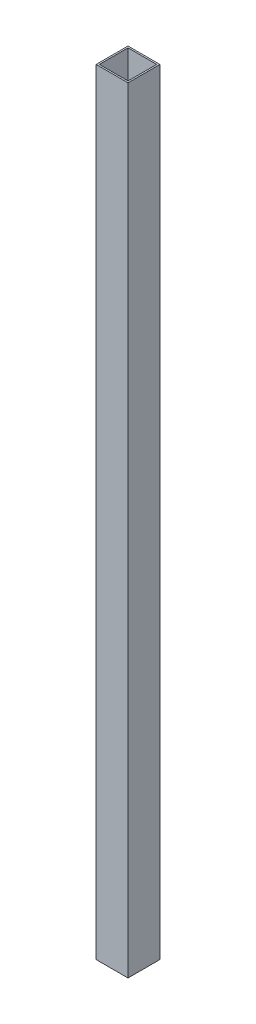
ISO-10303-21;
HEADER;
FILE_DESCRIPTION(('STEP AP214'),'2;1');
FILE_NAME('part.step','',(''),(''),'','','');
FILE_SCHEMA(('AUTOMOTIVE_DESIGN { 1 0 10303 214 1 1 1 1 }'));
ENDSEC;
DATA;
#1=APPLICATION_CONTEXT('core data for automotive mechanical design processes');
#2=APPLICATION_PROTOCOL_DEFINITION('international standard','automotive_design',2000,#1);
#3=PRODUCT_CONTEXT('',#1,'mechanical');
#4=PRODUCT('Part','Part','',(#3));
#5=PRODUCT_RELATED_PRODUCT_CATEGORY('part','',(#4));
#6=PRODUCT_DEFINITION_FORMATION('','',#4);
#7=PRODUCT_DEFINITION_CONTEXT('part definition',#1,'design');
#8=PRODUCT_DEFINITION('design','',#6,#7);
#9=PRODUCT_DEFINITION_SHAPE('','',#8);
#10=(LENGTH_UNIT() NAMED_UNIT(*) SI_UNIT(.MILLI.,.METRE.));
#11=(NAMED_UNIT(*) PLANE_ANGLE_UNIT() SI_UNIT($,.RADIAN.));
#12=(NAMED_UNIT(*) SI_UNIT($,.STERADIAN.) SOLID_ANGLE_UNIT());
#13=UNCERTAINTY_MEASURE_WITH_UNIT(LENGTH_MEASURE(1.E-05),#10,'distance_accuracy_value','');
#14=(GEOMETRIC_REPRESENTATION_CONTEXT(3) GLOBAL_UNCERTAINTY_ASSIGNED_CONTEXT((#13)) GLOBAL_UNIT_ASSIGNED_CONTEXT((#10,
#11,#12)) REPRESENTATION_CONTEXT('',''));
#15=CARTESIAN_POINT('',(0.,0.,0.));
#16=DIRECTION('',(0.,0.,1.));
#17=DIRECTION('',(1.,0.,0.));
#18=AXIS2_PLACEMENT_3D('',#15,#16,#17);
#19=CARTESIAN_POINT('',(25.,1216.,-25.));
#20=DIRECTION('',(-1.,0.,0.));
#21=DIRECTION('',(0.,0.,1.));
#22=AXIS2_PLACEMENT_3D('',#19,#20,#21);
#23=PLANE('',#22);
#24=DIRECTION('',(0.,0.,-1.));
#25=VECTOR('',#24,1.);
#26=CARTESIAN_POINT('',(25.,0.,-25.));
#27=LINE('',#26,#25);
#28=CARTESIAN_POINT('',(25.,0.,25.));
#29=VERTEX_POINT('',#28);
#30=CARTESIAN_POINT('',(25.,0.,-25.));
#31=VERTEX_POINT('',#30);
#32=EDGE_CURVE('E147',#29,#31,#27,.T.);
#33=ORIENTED_EDGE('',*,*,#32,.T.);
#34=DIRECTION('',(0.,-1.,0.));
#35=VECTOR('',#34,1.);
#36=CARTESIAN_POINT('',(25.,1216.,-25.));
#37=LINE('',#36,#35);
#38=CARTESIAN_POINT('',(25.,1216.,-25.));
#39=VERTEX_POINT('',#38);
#40=EDGE_CURVE('E11',#39,#31,#37,.T.);
#41=ORIENTED_EDGE('',*,*,#40,.F.);
#42=DIRECTION('',(0.,0.,-1.));
#43=VECTOR('',#42,1.);
#44=CARTESIAN_POINT('',(25.,1216.,-25.));
#45=LINE('',#44,#43);
#46=CARTESIAN_POINT('',(25.,1216.,25.));
#47=VERTEX_POINT('',#46);
#48=EDGE_CURVE('E136',#47,#39,#45,.T.);
#49=ORIENTED_EDGE('',*,*,#48,.F.);
#50=DIRECTION('',(0.,-1.,0.));
#51=VECTOR('',#50,1.);
#52=CARTESIAN_POINT('',(25.,1216.,25.));
#53=LINE('',#52,#51);
#54=EDGE_CURVE('E146',#47,#29,#53,.T.);
#55=ORIENTED_EDGE('',*,*,#54,.T.);
#56=EDGE_LOOP('',(#33,#41,#49,#55));
#57=FACE_BOUND('',#56,.T.);
#58=ADVANCED_FACE('F39',(#57),#23,.F.);
#59=CARTESIAN_POINT('',(-25.,1216.,-25.));
#60=DIRECTION('',(0.,0.,1.));
#61=DIRECTION('',(1.,0.,0.));
#62=AXIS2_PLACEMENT_3D('',#59,#60,#61);
#63=PLANE('',#62);
#64=DIRECTION('',(-1.,0.,0.));
#65=VECTOR('',#64,1.);
#66=CARTESIAN_POINT('',(-25.,0.,-25.));
#67=LINE('',#66,#65);
#68=CARTESIAN_POINT('',(-25.,0.,-25.));
#69=VERTEX_POINT('',#68);
#70=EDGE_CURVE('E150',#31,#69,#67,.T.);
#71=ORIENTED_EDGE('',*,*,#70,.T.);
#72=DIRECTION('',(0.,-1.,0.));
#73=VECTOR('',#72,1.);
#74=CARTESIAN_POINT('',(-25.,1216.,-25.));
#75=LINE('',#74,#73);
#76=CARTESIAN_POINT('',(-25.,1216.,-25.));
#77=VERTEX_POINT('',#76);
#78=EDGE_CURVE('E46',#77,#69,#75,.T.);
#79=ORIENTED_EDGE('',*,*,#78,.F.);
#80=DIRECTION('',(-1.,0.,0.));
#81=VECTOR('',#80,1.);
#82=CARTESIAN_POINT('',(-25.,1216.,-25.));
#83=LINE('',#82,#81);
#84=EDGE_CURVE('E139',#39,#77,#83,.T.);
#85=ORIENTED_EDGE('',*,*,#84,.F.);
#86=ORIENTED_EDGE('',*,*,#40,.T.);
#87=EDGE_LOOP('',(#71,#79,#85,#86));
#88=FACE_BOUND('',#87,.T.);
#89=ADVANCED_FACE('F178',(#88),#63,.F.);
#90=CARTESIAN_POINT('',(-25.,1216.,-25.));
#91=DIRECTION('',(1.,0.,0.));
#92=DIRECTION('',(0.,0.,-1.));
#93=AXIS2_PLACEMENT_3D('',#90,#91,#92);
#94=PLANE('',#93);
#95=DIRECTION('',(0.,0.,1.));
#96=VECTOR('',#95,1.);
#97=CARTESIAN_POINT('',(-25.,0.,-25.));
#98=LINE('',#97,#96);
#99=CARTESIAN_POINT('',(-25.,0.,25.));
#100=VERTEX_POINT('',#99);
#101=EDGE_CURVE('E152',#69,#100,#98,.T.);
#102=ORIENTED_EDGE('',*,*,#101,.T.);
#103=DIRECTION('',(0.,-1.,0.));
#104=VECTOR('',#103,1.);
#105=CARTESIAN_POINT('',(-25.,1216.,25.));
#106=LINE('',#105,#104);
#107=CARTESIAN_POINT('',(-25.,1216.,25.));
#108=VERTEX_POINT('',#107);
#109=EDGE_CURVE('E157',#108,#100,#106,.T.);
#110=ORIENTED_EDGE('',*,*,#109,.F.);
#111=DIRECTION('',(0.,0.,1.));
#112=VECTOR('',#111,1.);
#113=CARTESIAN_POINT('',(-25.,1216.,-25.));
#114=LINE('',#113,#112);
#115=EDGE_CURVE('E142',#77,#108,#114,.T.);
#116=ORIENTED_EDGE('',*,*,#115,.F.);
#117=ORIENTED_EDGE('',*,*,#78,.T.);
#118=EDGE_LOOP('',(#102,#110,#116,#117));
#119=FACE_BOUND('',#118,.T.);
#120=ADVANCED_FACE('F164',(#119),#94,.F.);
#121=CARTESIAN_POINT('',(-25.,1216.,25.));
#122=DIRECTION('',(0.,0.,-1.));
#123=DIRECTION('',(-1.,0.,0.));
#124=AXIS2_PLACEMENT_3D('',#121,#122,#123);
#125=PLANE('',#124);
#126=DIRECTION('',(1.,0.,0.));
#127=VECTOR('',#126,1.);
#128=CARTESIAN_POINT('',(-25.,0.,25.));
#129=LINE('',#128,#127);
#130=EDGE_CURVE('E140',#100,#29,#129,.T.);
#131=ORIENTED_EDGE('',*,*,#130,.T.);
#132=ORIENTED_EDGE('',*,*,#54,.F.);
#133=DIRECTION('',(1.,0.,0.));
#134=VECTOR('',#133,1.);
#135=CARTESIAN_POINT('',(-25.,1216.,25.));
#136=LINE('',#135,#134);
#137=EDGE_CURVE('E144',#108,#47,#136,.T.);
#138=ORIENTED_EDGE('',*,*,#137,.F.);
#139=ORIENTED_EDGE('',*,*,#109,.T.);
#140=EDGE_LOOP('',(#131,#132,#138,#139));
#141=FACE_BOUND('',#140,.T.);
#142=ADVANCED_FACE('F171',(#141),#125,.F.);
#143=CARTESIAN_POINT('',(0.,1216.,0.));
#144=DIRECTION('',(0.,1.,0.));
#145=DIRECTION('',(0.,0.,1.));
#146=AXIS2_PLACEMENT_3D('',#143,#144,#145);
#147=PLANE('',#146);
#148=DIRECTION('',(0.,0.,-1.));
#149=VECTOR('',#148,1.);
#150=CARTESIAN_POINT('',(22.5,1216.,-25.));
#151=LINE('',#150,#149);
#152=CARTESIAN_POINT('',(22.5,1216.,22.5));
#153=VERTEX_POINT('',#152);
#154=CARTESIAN_POINT('',(22.5,1216.,-22.5));
#155=VERTEX_POINT('',#154);
#156=EDGE_CURVE('E124',#153,#155,#151,.T.);
#157=ORIENTED_EDGE('',*,*,#156,.F.);
#158=DIRECTION('',(1.,0.,0.));
#159=VECTOR('',#158,1.);
#160=CARTESIAN_POINT('',(-25.,1216.,22.5));
#161=LINE('',#160,#159);
#162=CARTESIAN_POINT('',(-22.5,1216.,22.5));
#163=VERTEX_POINT('',#162);
#164=EDGE_CURVE('E108',#163,#153,#161,.T.);
#165=ORIENTED_EDGE('',*,*,#164,.F.);
#166=DIRECTION('',(0.,0.,1.));
#167=VECTOR('',#166,1.);
#168=CARTESIAN_POINT('',(-22.5,1216.,-25.));
#169=LINE('',#168,#167);
#170=CARTESIAN_POINT('',(-22.5,1216.,-22.5));
#171=VERTEX_POINT('',#170);
#172=EDGE_CURVE('E133',#171,#163,#169,.T.);
#173=ORIENTED_EDGE('',*,*,#172,.F.);
#174=DIRECTION('',(-1.,0.,0.));
#175=VECTOR('',#174,1.);
#176=CARTESIAN_POINT('',(-25.,1216.,-22.5));
#177=LINE('',#176,#175);
#178=EDGE_CURVE('E126',#155,#171,#177,.T.);
#179=ORIENTED_EDGE('',*,*,#178,.F.);
#180=EDGE_LOOP('',(#157,#165,#173,#179));
#181=FACE_BOUND('',#180,.T.);
#182=ORIENTED_EDGE('',*,*,#48,.T.);
#183=ORIENTED_EDGE('',*,*,#84,.T.);
#184=ORIENTED_EDGE('',*,*,#115,.T.);
#185=ORIENTED_EDGE('',*,*,#137,.T.);
#186=EDGE_LOOP('',(#182,#183,#184,#185));
#187=FACE_BOUND('',#186,.T.);
#188=ADVANCED_FACE('F177',(#181,#187),#147,.T.);
#189=CARTESIAN_POINT('',(0.,0.,0.));
#190=DIRECTION('',(0.,1.,0.));
#191=DIRECTION('',(0.,0.,1.));
#192=AXIS2_PLACEMENT_3D('',#189,#190,#191);
#193=PLANE('',#192);
#194=DIRECTION('',(1.,0.,0.));
#195=VECTOR('',#194,1.);
#196=CARTESIAN_POINT('',(-25.,0.,22.5));
#197=LINE('',#196,#195);
#198=CARTESIAN_POINT('',(-22.5,0.,22.5));
#199=VERTEX_POINT('',#198);
#200=CARTESIAN_POINT('',(22.5,0.,22.5));
#201=VERTEX_POINT('',#200);
#202=EDGE_CURVE('E106',#199,#201,#197,.T.);
#203=ORIENTED_EDGE('',*,*,#202,.T.);
#204=DIRECTION('',(0.,0.,-1.));
#205=VECTOR('',#204,1.);
#206=CARTESIAN_POINT('',(22.5,0.,-25.));
#207=LINE('',#206,#205);
#208=CARTESIAN_POINT('',(22.5,0.,-22.5));
#209=VERTEX_POINT('',#208);
#210=EDGE_CURVE('E114',#201,#209,#207,.T.);
#211=ORIENTED_EDGE('',*,*,#210,.T.);
#212=DIRECTION('',(-1.,0.,0.));
#213=VECTOR('',#212,1.);
#214=CARTESIAN_POINT('',(-25.,0.,-22.5));
#215=LINE('',#214,#213);
#216=CARTESIAN_POINT('',(-22.5,0.,-22.5));
#217=VERTEX_POINT('',#216);
#218=EDGE_CURVE('E120',#209,#217,#215,.T.);
#219=ORIENTED_EDGE('',*,*,#218,.T.);
#220=DIRECTION('',(0.,0.,1.));
#221=VECTOR('',#220,1.);
#222=CARTESIAN_POINT('',(-22.5,0.,-25.));
#223=LINE('',#222,#221);
#224=EDGE_CURVE('E60',#217,#199,#223,.T.);
#225=ORIENTED_EDGE('',*,*,#224,.T.);
#226=EDGE_LOOP('',(#203,#211,#219,#225));
#227=FACE_BOUND('',#226,.T.);
#228=ORIENTED_EDGE('',*,*,#32,.F.);
#229=ORIENTED_EDGE('',*,*,#130,.F.);
#230=ORIENTED_EDGE('',*,*,#101,.F.);
#231=ORIENTED_EDGE('',*,*,#70,.F.);
#232=EDGE_LOOP('',(#228,#229,#230,#231));
#233=FACE_BOUND('',#232,.T.);
#234=ADVANCED_FACE('F122',(#227,#233),#193,.F.);
#235=CARTESIAN_POINT('',(22.5,1216.,-25.));
#236=DIRECTION('',(-1.,0.,0.));
#237=DIRECTION('',(0.,0.,1.));
#238=AXIS2_PLACEMENT_3D('',#235,#236,#237);
#239=PLANE('',#238);
#240=ORIENTED_EDGE('',*,*,#210,.F.);
#241=DIRECTION('',(0.,-1.,0.));
#242=VECTOR('',#241,1.);
#243=CARTESIAN_POINT('',(22.5,1216.,22.5));
#244=LINE('',#243,#242);
#245=EDGE_CURVE('E102',#153,#201,#244,.T.);
#246=ORIENTED_EDGE('',*,*,#245,.F.);
#247=ORIENTED_EDGE('',*,*,#156,.T.);
#248=DIRECTION('',(0.,-1.,0.));
#249=VECTOR('',#248,1.);
#250=CARTESIAN_POINT('',(22.5,1216.,-22.5));
#251=LINE('',#250,#249);
#252=EDGE_CURVE('E117',#155,#209,#251,.T.);
#253=ORIENTED_EDGE('',*,*,#252,.T.);
#254=EDGE_LOOP('',(#240,#246,#247,#253));
#255=FACE_BOUND('',#254,.T.);
#256=ADVANCED_FACE('F115',(#255),#239,.T.);
#257=CARTESIAN_POINT('',(-25.,1216.,-22.5));
#258=DIRECTION('',(0.,0.,1.));
#259=DIRECTION('',(1.,0.,0.));
#260=AXIS2_PLACEMENT_3D('',#257,#258,#259);
#261=PLANE('',#260);
#262=ORIENTED_EDGE('',*,*,#218,.F.);
#263=ORIENTED_EDGE('',*,*,#252,.F.);
#264=ORIENTED_EDGE('',*,*,#178,.T.);
#265=DIRECTION('',(0.,-1.,0.));
#266=VECTOR('',#265,1.);
#267=CARTESIAN_POINT('',(-22.5,1216.,-22.5));
#268=LINE('',#267,#266);
#269=EDGE_CURVE('E262',#171,#217,#268,.T.);
#270=ORIENTED_EDGE('',*,*,#269,.T.);
#271=EDGE_LOOP('',(#262,#263,#264,#270));
#272=FACE_BOUND('',#271,.T.);
#273=ADVANCED_FACE('F198',(#272),#261,.T.);
#274=CARTESIAN_POINT('',(-22.5,1216.,-25.));
#275=DIRECTION('',(1.,0.,0.));
#276=DIRECTION('',(0.,0.,-1.));
#277=AXIS2_PLACEMENT_3D('',#274,#275,#276);
#278=PLANE('',#277);
#279=ORIENTED_EDGE('',*,*,#224,.F.);
#280=ORIENTED_EDGE('',*,*,#269,.F.);
#281=ORIENTED_EDGE('',*,*,#172,.T.);
#282=DIRECTION('',(0.,-1.,0.));
#283=VECTOR('',#282,1.);
#284=CARTESIAN_POINT('',(-22.5,1216.,22.5));
#285=LINE('',#284,#283);
#286=EDGE_CURVE('E53',#163,#199,#285,.T.);
#287=ORIENTED_EDGE('',*,*,#286,.T.);
#288=EDGE_LOOP('',(#279,#280,#281,#287));
#289=FACE_BOUND('',#288,.T.);
#290=ADVANCED_FACE('F195',(#289),#278,.T.);
#291=CARTESIAN_POINT('',(-25.,1216.,22.5));
#292=DIRECTION('',(0.,0.,-1.));
#293=DIRECTION('',(-1.,0.,0.));
#294=AXIS2_PLACEMENT_3D('',#291,#292,#293);
#295=PLANE('',#294);
#296=ORIENTED_EDGE('',*,*,#202,.F.);
#297=ORIENTED_EDGE('',*,*,#286,.F.);
#298=ORIENTED_EDGE('',*,*,#164,.T.);
#299=ORIENTED_EDGE('',*,*,#245,.T.);
#300=EDGE_LOOP('',(#296,#297,#298,#299));
#301=FACE_BOUND('',#300,.T.);
#302=ADVANCED_FACE('F104',(#301),#295,.T.);
#303=CLOSED_SHELL('',(#58,#89,#120,#142,#188,#234,#256,#273,#290,#302));
#304=MANIFOLD_SOLID_BREP('B2',#303);
#305=ADVANCED_BREP_SHAPE_REPRESENTATION('',(#18,#304),#14);
#306=SHAPE_DEFINITION_REPRESENTATION(#9,#305);
ENDSEC;
END-ISO-10303-21;
